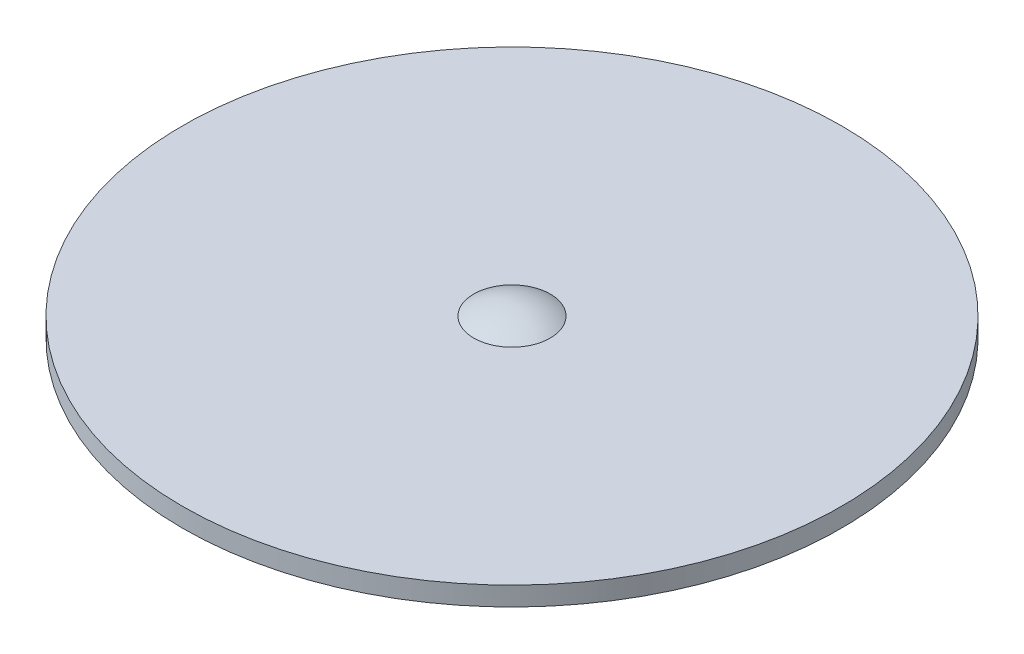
ISO-10303-21;
HEADER;
FILE_DESCRIPTION(('STEP AP214'),'2;1');
FILE_NAME('part.step','',(''),(''),'','','');
FILE_SCHEMA(('AUTOMOTIVE_DESIGN { 1 0 10303 214 1 1 1 1 }'));
ENDSEC;
DATA;
#1=APPLICATION_CONTEXT('core data for automotive mechanical design processes');
#2=APPLICATION_PROTOCOL_DEFINITION('international standard','automotive_design',2000,#1);
#3=PRODUCT_CONTEXT('',#1,'mechanical');
#4=PRODUCT('Part','Part','',(#3));
#5=PRODUCT_RELATED_PRODUCT_CATEGORY('part','',(#4));
#6=PRODUCT_DEFINITION_FORMATION('','',#4);
#7=PRODUCT_DEFINITION_CONTEXT('part definition',#1,'design');
#8=PRODUCT_DEFINITION('design','',#6,#7);
#9=PRODUCT_DEFINITION_SHAPE('','',#8);
#10=(LENGTH_UNIT() NAMED_UNIT(*) SI_UNIT(.MILLI.,.METRE.));
#11=(NAMED_UNIT(*) PLANE_ANGLE_UNIT() SI_UNIT($,.RADIAN.));
#12=(NAMED_UNIT(*) SI_UNIT($,.STERADIAN.) SOLID_ANGLE_UNIT());
#13=UNCERTAINTY_MEASURE_WITH_UNIT(LENGTH_MEASURE(1.E-05),#10,'distance_accuracy_value','');
#14=(GEOMETRIC_REPRESENTATION_CONTEXT(3) GLOBAL_UNCERTAINTY_ASSIGNED_CONTEXT((#13)) GLOBAL_UNIT_ASSIGNED_CONTEXT((#10,
#11,#12)) REPRESENTATION_CONTEXT('',''));
#15=CARTESIAN_POINT('',(0.,0.,0.));
#16=DIRECTION('',(0.,0.,1.));
#17=DIRECTION('',(1.,0.,0.));
#18=AXIS2_PLACEMENT_3D('',#15,#16,#17);
#19=CARTESIAN_POINT('',(0.,-3.08371875,0.));
#20=DIRECTION('',(0.,1.,0.));
#21=DIRECTION('',(-1.,0.,0.));
#22=AXIS2_PLACEMENT_3D('',#19,#20,#21);
#23=SPHERICAL_SURFACE('',#22,3.59171875);
#24=CARTESIAN_POINT('',(0.,0.,0.));
#25=DIRECTION('',(0.,1.,0.));
#26=DIRECTION('',(0.,0.,1.));
#27=AXIS2_PLACEMENT_3D('',#24,#25,#26);
#28=CIRCLE('',#27,1.8415);
#29=CARTESIAN_POINT('',(0.,0.,1.8415));
#30=VERTEX_POINT('',#29);
#31=EDGE_CURVE('E49',#30,#30,#28,.T.);
#32=ORIENTED_EDGE('',*,*,#31,.T.);
#33=EDGE_LOOP('',(#32));
#34=FACE_BOUND('',#33,.T.);
#35=ADVANCED_FACE('F35',(#34),#23,.T.);
#36=CARTESIAN_POINT('',(0.,-3.08371875,0.));
#37=DIRECTION('',(0.,1.,0.));
#38=DIRECTION('',(-1.,0.,0.));
#39=AXIS2_PLACEMENT_3D('',#36,#37,#38);
#40=SPHERICAL_SURFACE('',#39,2.67731875);
#41=CARTESIAN_POINT('',(0.,-0.9144,0.));
#42=DIRECTION('',(0.,1.,0.));
#43=DIRECTION('',(0.,0.,1.));
#44=AXIS2_PLACEMENT_3D('',#41,#42,#43);
#45=CIRCLE('',#44,1.56910542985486);
#46=CARTESIAN_POINT('',(0.,-0.9144,1.56910542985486));
#47=VERTEX_POINT('',#46);
#48=EDGE_CURVE('E10',#47,#47,#45,.T.);
#49=ORIENTED_EDGE('',*,*,#48,.F.);
#50=EDGE_LOOP('',(#49));
#51=FACE_BOUND('',#50,.T.);
#52=ADVANCED_FACE('F69',(#51),#40,.F.);
#53=CARTESIAN_POINT('',(-15.875,-0.9144,0.));
#54=DIRECTION('',(0.,-1.,0.));
#55=DIRECTION('',(0.,0.,-1.));
#56=AXIS2_PLACEMENT_3D('',#53,#54,#55);
#57=PLANE('',#56);
#58=ORIENTED_EDGE('',*,*,#48,.T.);
#59=EDGE_LOOP('',(#58));
#60=FACE_BOUND('',#59,.T.);
#61=CARTESIAN_POINT('',(0.,-0.9144,0.));
#62=DIRECTION('',(0.,1.,0.));
#63=DIRECTION('',(0.,0.,1.));
#64=AXIS2_PLACEMENT_3D('',#61,#62,#63);
#65=CIRCLE('',#64,15.875);
#66=CARTESIAN_POINT('',(0.,-0.9144,15.875));
#67=VERTEX_POINT('',#66);
#68=EDGE_CURVE('E41',#67,#67,#65,.T.);
#69=ORIENTED_EDGE('',*,*,#68,.F.);
#70=EDGE_LOOP('',(#69));
#71=FACE_BOUND('',#70,.T.);
#72=ADVANCED_FACE('F64',(#60,#71),#57,.T.);
#73=CARTESIAN_POINT('',(0.,0.,0.));
#74=DIRECTION('',(0.,1.,0.));
#75=DIRECTION('',(0.,0.,1.));
#76=AXIS2_PLACEMENT_3D('',#73,#74,#75);
#77=CYLINDRICAL_SURFACE('',#76,15.875);
#78=ORIENTED_EDGE('',*,*,#68,.T.);
#79=EDGE_LOOP('',(#78));
#80=FACE_BOUND('',#79,.T.);
#81=CARTESIAN_POINT('',(0.,0.,0.));
#82=DIRECTION('',(0.,1.,0.));
#83=DIRECTION('',(0.,0.,1.));
#84=AXIS2_PLACEMENT_3D('',#81,#82,#83);
#85=CIRCLE('',#84,15.875);
#86=CARTESIAN_POINT('',(0.,0.,15.875));
#87=VERTEX_POINT('',#86);
#88=EDGE_CURVE('E45',#87,#87,#85,.T.);
#89=ORIENTED_EDGE('',*,*,#88,.F.);
#90=EDGE_LOOP('',(#89));
#91=FACE_BOUND('',#90,.T.);
#92=ADVANCED_FACE('F59',(#80,#91),#77,.T.);
#93=CARTESIAN_POINT('',(-15.875,0.,0.));
#94=DIRECTION('',(0.,-1.,0.));
#95=DIRECTION('',(0.,0.,-1.));
#96=AXIS2_PLACEMENT_3D('',#93,#94,#95);
#97=PLANE('',#96);
#98=ORIENTED_EDGE('',*,*,#31,.F.);
#99=EDGE_LOOP('',(#98));
#100=FACE_BOUND('',#99,.T.);
#101=ORIENTED_EDGE('',*,*,#88,.T.);
#102=EDGE_LOOP('',(#101));
#103=FACE_BOUND('',#102,.T.);
#104=ADVANCED_FACE('F56',(#100,#103),#97,.F.);
#105=CLOSED_SHELL('',(#35,#52,#72,#92,#104));
#106=MANIFOLD_SOLID_BREP('B2',#105);
#107=ADVANCED_BREP_SHAPE_REPRESENTATION('',(#18,#106),#14);
#108=SHAPE_DEFINITION_REPRESENTATION(#9,#107);
ENDSEC;
END-ISO-10303-21;
